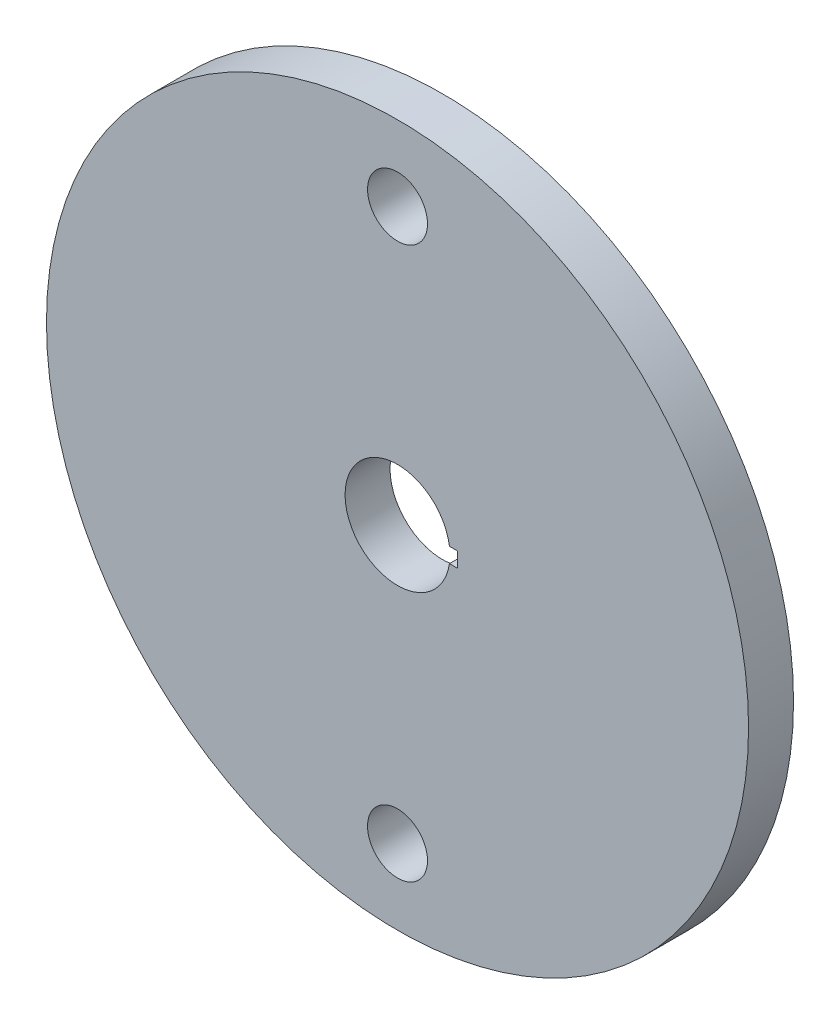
ISO-10303-21;
HEADER;
FILE_DESCRIPTION(('STEP AP214'),'2;1');
FILE_NAME('part.step','',(''),(''),'','','');
FILE_SCHEMA(('AUTOMOTIVE_DESIGN { 1 0 10303 214 1 1 1 1 }'));
ENDSEC;
DATA;
#1=APPLICATION_CONTEXT('core data for automotive mechanical design processes');
#2=APPLICATION_PROTOCOL_DEFINITION('international standard','automotive_design',2000,#1);
#3=PRODUCT_CONTEXT('',#1,'mechanical');
#4=PRODUCT('Part','Part','',(#3));
#5=PRODUCT_RELATED_PRODUCT_CATEGORY('part','',(#4));
#6=PRODUCT_DEFINITION_FORMATION('','',#4);
#7=PRODUCT_DEFINITION_CONTEXT('part definition',#1,'design');
#8=PRODUCT_DEFINITION('design','',#6,#7);
#9=PRODUCT_DEFINITION_SHAPE('','',#8);
#10=(LENGTH_UNIT() NAMED_UNIT(*) SI_UNIT(.MILLI.,.METRE.));
#11=(NAMED_UNIT(*) PLANE_ANGLE_UNIT() SI_UNIT($,.RADIAN.));
#12=(NAMED_UNIT(*) SI_UNIT($,.STERADIAN.) SOLID_ANGLE_UNIT());
#13=UNCERTAINTY_MEASURE_WITH_UNIT(LENGTH_MEASURE(1.E-05),#10,'distance_accuracy_value','');
#14=(GEOMETRIC_REPRESENTATION_CONTEXT(3) GLOBAL_UNCERTAINTY_ASSIGNED_CONTEXT((#13)) GLOBAL_UNIT_ASSIGNED_CONTEXT((#10,
#11,#12)) REPRESENTATION_CONTEXT('',''));
#15=CARTESIAN_POINT('',(0.,0.,0.));
#16=DIRECTION('',(0.,0.,1.));
#17=DIRECTION('',(1.,0.,0.));
#18=AXIS2_PLACEMENT_3D('',#15,#16,#17);
#19=CARTESIAN_POINT('',(127.,31.75,3.81));
#20=DIRECTION('',(0.,0.,-1.));
#21=DIRECTION('',(-1.,0.,0.));
#22=AXIS2_PLACEMENT_3D('',#19,#20,#21);
#23=CYLINDRICAL_SURFACE('',#22,29.7475774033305);
#24=CARTESIAN_POINT('',(127.,31.75,3.81));
#25=DIRECTION('',(0.,0.,1.));
#26=DIRECTION('',(1.,0.,0.));
#27=AXIS2_PLACEMENT_3D('',#24,#25,#26);
#28=CIRCLE('',#27,29.7475774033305);
#29=CARTESIAN_POINT('',(97.2524225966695,31.75,3.81));
#30=VERTEX_POINT('',#29);
#31=EDGE_CURVE('E104',#30,#30,#28,.T.);
#32=CARTESIAN_POINT('',(127.,31.75,0.));
#33=DIRECTION('',(0.,0.,1.));
#34=DIRECTION('',(1.,0.,0.));
#35=AXIS2_PLACEMENT_3D('',#32,#33,#34);
#36=CIRCLE('',#35,29.7475774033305);
#37=CARTESIAN_POINT('',(97.2524225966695,31.75,0.));
#38=VERTEX_POINT('',#37);
#39=EDGE_CURVE('E101',#38,#38,#36,.T.);
#40=CARTESIAN_POINT('',(97.2524225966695,31.75,3.81));
#41=CARTESIAN_POINT('',(97.2524225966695,31.75,3.7703125));
#42=CARTESIAN_POINT('',(97.2524225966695,31.75,3.730625));
#43=CARTESIAN_POINT('',(97.2524225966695,31.75,3.65125));
#44=CARTESIAN_POINT('',(97.2524225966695,31.75,3.6115625));
#45=CARTESIAN_POINT('',(97.2524225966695,31.75,3.5321875));
#46=CARTESIAN_POINT('',(97.2524225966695,31.75,3.4925));
#47=CARTESIAN_POINT('',(97.2524225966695,31.75,3.413125));
#48=CARTESIAN_POINT('',(97.2524225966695,31.75,3.3734375));
#49=CARTESIAN_POINT('',(97.2524225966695,31.75,3.2940625));
#50=CARTESIAN_POINT('',(97.2524225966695,31.75,3.254375));
#51=CARTESIAN_POINT('',(97.2524225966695,31.75,3.175));
#52=CARTESIAN_POINT('',(97.2524225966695,31.75,3.1353125));
#53=CARTESIAN_POINT('',(97.2524225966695,31.75,3.0559375));
#54=CARTESIAN_POINT('',(97.2524225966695,31.75,3.01625));
#55=CARTESIAN_POINT('',(97.2524225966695,31.75,2.936875));
#56=CARTESIAN_POINT('',(97.2524225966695,31.75,2.8971875));
#57=CARTESIAN_POINT('',(97.2524225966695,31.75,2.8178125));
#58=CARTESIAN_POINT('',(97.2524225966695,31.75,2.778125));
#59=CARTESIAN_POINT('',(97.2524225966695,31.75,2.69875));
#60=CARTESIAN_POINT('',(97.2524225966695,31.75,2.6590625));
#61=CARTESIAN_POINT('',(97.2524225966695,31.75,2.5796875));
#62=CARTESIAN_POINT('',(97.2524225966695,31.75,2.54));
#63=CARTESIAN_POINT('',(97.2524225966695,31.75,2.460625));
#64=CARTESIAN_POINT('',(97.2524225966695,31.75,2.4209375));
#65=CARTESIAN_POINT('',(97.2524225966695,31.75,2.3415625));
#66=CARTESIAN_POINT('',(97.2524225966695,31.75,2.301875));
#67=CARTESIAN_POINT('',(97.2524225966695,31.75,2.2225));
#68=CARTESIAN_POINT('',(97.2524225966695,31.75,2.1828125));
#69=CARTESIAN_POINT('',(97.2524225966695,31.75,2.1034375));
#70=CARTESIAN_POINT('',(97.2524225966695,31.75,2.06375));
#71=CARTESIAN_POINT('',(97.2524225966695,31.75,1.984375));
#72=CARTESIAN_POINT('',(97.2524225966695,31.75,1.9446875));
#73=CARTESIAN_POINT('',(97.2524225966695,31.75,1.8653125));
#74=CARTESIAN_POINT('',(97.2524225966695,31.75,1.825625));
#75=CARTESIAN_POINT('',(97.2524225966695,31.75,1.74625));
#76=CARTESIAN_POINT('',(97.2524225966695,31.75,1.7065625));
#77=CARTESIAN_POINT('',(97.2524225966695,31.75,1.6271875));
#78=CARTESIAN_POINT('',(97.2524225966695,31.75,1.5875));
#79=CARTESIAN_POINT('',(97.2524225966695,31.75,1.508125));
#80=CARTESIAN_POINT('',(97.2524225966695,31.75,1.4684375));
#81=CARTESIAN_POINT('',(97.2524225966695,31.75,1.3890625));
#82=CARTESIAN_POINT('',(97.2524225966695,31.75,1.349375));
#83=CARTESIAN_POINT('',(97.2524225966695,31.75,1.27));
#84=CARTESIAN_POINT('',(97.2524225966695,31.75,1.2303125));
#85=CARTESIAN_POINT('',(97.2524225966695,31.75,1.1509375));
#86=CARTESIAN_POINT('',(97.2524225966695,31.75,1.11125));
#87=CARTESIAN_POINT('',(97.2524225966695,31.75,1.031875));
#88=CARTESIAN_POINT('',(97.2524225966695,31.75,0.9921875));
#89=CARTESIAN_POINT('',(97.2524225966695,31.75,0.9128125));
#90=CARTESIAN_POINT('',(97.2524225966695,31.75,0.873125));
#91=CARTESIAN_POINT('',(97.2524225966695,31.75,0.79375));
#92=CARTESIAN_POINT('',(97.2524225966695,31.75,0.7540625));
#93=CARTESIAN_POINT('',(97.2524225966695,31.75,0.6746875));
#94=CARTESIAN_POINT('',(97.2524225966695,31.75,0.635));
#95=CARTESIAN_POINT('',(97.2524225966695,31.75,0.555625));
#96=CARTESIAN_POINT('',(97.2524225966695,31.75,0.5159375));
#97=CARTESIAN_POINT('',(97.2524225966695,31.75,0.4365625));
#98=CARTESIAN_POINT('',(97.2524225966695,31.75,0.396875));
#99=CARTESIAN_POINT('',(97.2524225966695,31.75,0.3175));
#100=CARTESIAN_POINT('',(97.2524225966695,31.75,0.2778125));
#101=CARTESIAN_POINT('',(97.2524225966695,31.75,0.1984375));
#102=CARTESIAN_POINT('',(97.2524225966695,31.75,0.15875));
#103=CARTESIAN_POINT('',(97.2524225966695,31.75,0.0793749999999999));
#104=CARTESIAN_POINT('',(97.2524225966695,31.75,0.0396874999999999));
#105=CARTESIAN_POINT('',(97.2524225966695,31.75,0.));
#106=B_SPLINE_CURVE_WITH_KNOTS('',3,(#40,#41,#42,#43,#44,#45,#46,#47,#48,#49,#50,#51,#52,#53,
#54,#55,#56,#57,#58,#59,#60,#61,#62,#63,#64,#65,#66,#67,#68,#69,#70,#71,#72,#73,#74,#75,#76,#77,
#78,#79,#80,#81,#82,#83,#84,#85,#86,#87,#88,#89,#90,#91,#92,#93,#94,#95,#96,#97,#98,#99,#100,
#101,#102,#103,#104,#105),.UNSPECIFIED.,.F.,.F.,(4,2,2,2,2,2,2,2,2,2,2,2,2,2,2,2,2,2,2,2,2,2,2,
2,2,2,2,2,2,2,2,2,4),(0.,0.1190625,0.238125,0.3571875,0.47625,0.595312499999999,0.714375,
0.833437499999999,0.952499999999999,1.0715625,1.190625,1.3096875,1.42875,1.5478125,1.666875,
1.7859375,1.905,2.0240625,2.143125,2.2621875,2.38125,2.5003125,2.619375,2.7384375,2.8575,
2.9765625,3.095625,3.2146875,3.33375,3.4528125,3.571875,3.6909375,3.81),.UNSPECIFIED.);
#107=EDGE_CURVE('BSEAM33',#30,#38,#106,.T.);
#108=ORIENTED_EDGE('',*,*,#31,.F.);
#109=ORIENTED_EDGE('',*,*,#39,.T.);
#110=ORIENTED_EDGE('',*,*,#107,.T.);
#111=ORIENTED_EDGE('',*,*,#107,.F.);
#112=EDGE_LOOP('',(#108,#110,#109,#111));
#113=FACE_BOUND('',#112,.T.);
#114=ADVANCED_FACE('F33',(#113),#23,.T.);
#115=CARTESIAN_POINT('',(127.,31.75,3.81));
#116=DIRECTION('',(0.,0.,1.));
#117=DIRECTION('',(1.,0.,0.));
#118=AXIS2_PLACEMENT_3D('',#115,#116,#117);
#119=PLANE('',#118);
#120=CARTESIAN_POINT('',(127.000000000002,8.38199999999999,3.81));
#121=DIRECTION('',(0.,0.,1.));
#122=DIRECTION('',(1.,0.,0.));
#123=AXIS2_PLACEMENT_3D('',#120,#121,#122);
#124=CIRCLE('',#123,2.53999999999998);
#125=CARTESIAN_POINT('',(129.540000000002,8.38199999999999,3.81));
#126=VERTEX_POINT('',#125);
#127=EDGE_CURVE('E122',#126,#126,#124,.T.);
#128=ORIENTED_EDGE('',*,*,#127,.F.);
#129=EDGE_LOOP('',(#128));
#130=FACE_BOUND('',#129,.T.);
#131=CARTESIAN_POINT('',(127.,55.118,3.81));
#132=DIRECTION('',(0.,0.,1.));
#133=DIRECTION('',(1.,0.,0.));
#134=AXIS2_PLACEMENT_3D('',#131,#132,#133);
#135=CIRCLE('',#134,2.53999999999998);
#136=CARTESIAN_POINT('',(129.54,55.118,3.81));
#137=VERTEX_POINT('',#136);
#138=EDGE_CURVE('E114',#137,#137,#135,.T.);
#139=ORIENTED_EDGE('',*,*,#138,.F.);
#140=EDGE_LOOP('',(#139));
#141=FACE_BOUND('',#140,.T.);
#142=CARTESIAN_POINT('',(127.,31.75,3.81));
#143=DIRECTION('',(0.,0.,1.));
#144=DIRECTION('',(1.,0.,0.));
#145=AXIS2_PLACEMENT_3D('',#142,#143,#144);
#146=CIRCLE('',#145,4.445);
#147=CARTESIAN_POINT('',(131.399409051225,32.385,3.81));
#148=VERTEX_POINT('',#147);
#149=CARTESIAN_POINT('',(131.399409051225,31.115,3.81));
#150=VERTEX_POINT('',#149);
#151=EDGE_CURVE('E49',#148,#150,#146,.T.);
#152=ORIENTED_EDGE('',*,*,#151,.F.);
#153=DIRECTION('',(1.,0.,0.));
#154=VECTOR('',#153,1.);
#155=CARTESIAN_POINT('',(0.,32.385,3.81));
#156=LINE('',#155,#154);
#157=CARTESIAN_POINT('',(132.08,32.385,3.81));
#158=VERTEX_POINT('',#157);
#159=EDGE_CURVE('E94',#148,#158,#156,.T.);
#160=ORIENTED_EDGE('',*,*,#159,.T.);
#161=DIRECTION('',(0.,-1.,0.));
#162=VECTOR('',#161,1.);
#163=CARTESIAN_POINT('',(132.08,0.,3.81));
#164=LINE('',#163,#162);
#165=CARTESIAN_POINT('',(132.08,31.115,3.81));
#166=VERTEX_POINT('',#165);
#167=EDGE_CURVE('E78',#158,#166,#164,.T.);
#168=ORIENTED_EDGE('',*,*,#167,.T.);
#169=DIRECTION('',(1.,0.,0.));
#170=VECTOR('',#169,1.);
#171=CARTESIAN_POINT('',(0.,31.115,3.81));
#172=LINE('',#171,#170);
#173=EDGE_CURVE('E87',#150,#166,#172,.T.);
#174=ORIENTED_EDGE('',*,*,#173,.F.);
#175=EDGE_LOOP('',(#152,#160,#168,#174));
#176=FACE_BOUND('',#175,.T.);
#177=ORIENTED_EDGE('',*,*,#31,.T.);
#178=EDGE_LOOP('',(#177));
#179=FACE_BOUND('',#178,.T.);
#180=ADVANCED_FACE('F91',(#130,#141,#176,#179),#119,.T.);
#181=CARTESIAN_POINT('',(127.,31.75,0.));
#182=DIRECTION('',(0.,0.,1.));
#183=DIRECTION('',(1.,0.,0.));
#184=AXIS2_PLACEMENT_3D('',#181,#182,#183);
#185=PLANE('',#184);
#186=CARTESIAN_POINT('',(127.000000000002,8.38199999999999,0.));
#187=DIRECTION('',(0.,0.,1.));
#188=DIRECTION('',(1.,0.,0.));
#189=AXIS2_PLACEMENT_3D('',#186,#187,#188);
#190=CIRCLE('',#189,2.53999999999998);
#191=CARTESIAN_POINT('',(129.540000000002,8.38199999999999,0.));
#192=VERTEX_POINT('',#191);
#193=EDGE_CURVE('E36',#192,#192,#190,.T.);
#194=ORIENTED_EDGE('',*,*,#193,.T.);
#195=EDGE_LOOP('',(#194));
#196=FACE_BOUND('',#195,.T.);
#197=CARTESIAN_POINT('',(127.,55.118,0.));
#198=DIRECTION('',(0.,0.,1.));
#199=DIRECTION('',(1.,0.,0.));
#200=AXIS2_PLACEMENT_3D('',#197,#198,#199);
#201=CIRCLE('',#200,2.53999999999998);
#202=CARTESIAN_POINT('',(129.54,55.118,0.));
#203=VERTEX_POINT('',#202);
#204=EDGE_CURVE('E112',#203,#203,#201,.T.);
#205=ORIENTED_EDGE('',*,*,#204,.T.);
#206=EDGE_LOOP('',(#205));
#207=FACE_BOUND('',#206,.T.);
#208=DIRECTION('',(1.,0.,0.));
#209=VECTOR('',#208,1.);
#210=CARTESIAN_POINT('',(127.,32.385,0.));
#211=LINE('',#210,#209);
#212=CARTESIAN_POINT('',(131.399409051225,32.385,0.));
#213=VERTEX_POINT('',#212);
#214=CARTESIAN_POINT('',(132.08,32.385,0.));
#215=VERTEX_POINT('',#214);
#216=EDGE_CURVE('E41',#213,#215,#211,.T.);
#217=ORIENTED_EDGE('',*,*,#216,.F.);
#218=CARTESIAN_POINT('',(127.,31.75,0.));
#219=DIRECTION('',(0.,0.,1.));
#220=DIRECTION('',(1.,0.,0.));
#221=AXIS2_PLACEMENT_3D('',#218,#219,#220);
#222=CIRCLE('',#221,4.445);
#223=CARTESIAN_POINT('',(131.399409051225,31.115,0.));
#224=VERTEX_POINT('',#223);
#225=EDGE_CURVE('E11',#213,#224,#222,.T.);
#226=ORIENTED_EDGE('',*,*,#225,.T.);
#227=DIRECTION('',(1.,0.,0.));
#228=VECTOR('',#227,1.);
#229=CARTESIAN_POINT('',(127.,31.115,0.));
#230=LINE('',#229,#228);
#231=CARTESIAN_POINT('',(132.08,31.115,0.));
#232=VERTEX_POINT('',#231);
#233=EDGE_CURVE('E107',#224,#232,#230,.T.);
#234=ORIENTED_EDGE('',*,*,#233,.T.);
#235=DIRECTION('',(0.,-1.,0.));
#236=VECTOR('',#235,1.);
#237=CARTESIAN_POINT('',(132.08,31.75,0.));
#238=LINE('',#237,#236);
#239=EDGE_CURVE('E81',#215,#232,#238,.T.);
#240=ORIENTED_EDGE('',*,*,#239,.F.);
#241=EDGE_LOOP('',(#217,#226,#234,#240));
#242=FACE_BOUND('',#241,.T.);
#243=ORIENTED_EDGE('',*,*,#39,.F.);
#244=EDGE_LOOP('',(#243));
#245=FACE_BOUND('',#244,.T.);
#246=ADVANCED_FACE('F132',(#196,#207,#242,#245),#185,.F.);
#247=CARTESIAN_POINT('',(127.,31.75,-1.27));
#248=DIRECTION('',(0.,0.,1.));
#249=DIRECTION('',(1.,0.,0.));
#250=AXIS2_PLACEMENT_3D('',#247,#248,#249);
#251=CYLINDRICAL_SURFACE('',#250,4.445);
#252=DIRECTION('',(0.,0.,1.));
#253=VECTOR('',#252,1.);
#254=CARTESIAN_POINT('',(131.399409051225,32.385,-1.27));
#255=LINE('',#254,#253);
#256=EDGE_CURVE('E99',#213,#148,#255,.T.);
#257=ORIENTED_EDGE('',*,*,#256,.T.);
#258=ORIENTED_EDGE('',*,*,#151,.T.);
#259=DIRECTION('',(0.,0.,1.));
#260=VECTOR('',#259,1.);
#261=CARTESIAN_POINT('',(131.399409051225,31.115,-1.27));
#262=LINE('',#261,#260);
#263=EDGE_CURVE('E84',#224,#150,#262,.T.);
#264=ORIENTED_EDGE('',*,*,#263,.F.);
#265=ORIENTED_EDGE('',*,*,#225,.F.);
#266=EDGE_LOOP('',(#257,#258,#264,#265));
#267=FACE_BOUND('',#266,.T.);
#268=ADVANCED_FACE('F138',(#267),#251,.F.);
#269=CARTESIAN_POINT('',(0.,32.385,-1.27));
#270=DIRECTION('',(0.,-1.,0.));
#271=DIRECTION('',(0.,0.,-1.));
#272=AXIS2_PLACEMENT_3D('',#269,#270,#271);
#273=PLANE('',#272);
#274=ORIENTED_EDGE('',*,*,#216,.T.);
#275=DIRECTION('',(0.,0.,1.));
#276=VECTOR('',#275,1.);
#277=CARTESIAN_POINT('',(132.08,32.385,-1.27));
#278=LINE('',#277,#276);
#279=EDGE_CURVE('E83',#215,#158,#278,.T.);
#280=ORIENTED_EDGE('',*,*,#279,.T.);
#281=ORIENTED_EDGE('',*,*,#159,.F.);
#282=ORIENTED_EDGE('',*,*,#256,.F.);
#283=EDGE_LOOP('',(#274,#280,#281,#282));
#284=FACE_BOUND('',#283,.T.);
#285=ADVANCED_FACE('F144',(#284),#273,.T.);
#286=CARTESIAN_POINT('',(132.08,0.,-1.27));
#287=DIRECTION('',(-1.,0.,0.));
#288=DIRECTION('',(0.,0.,1.));
#289=AXIS2_PLACEMENT_3D('',#286,#287,#288);
#290=PLANE('',#289);
#291=ORIENTED_EDGE('',*,*,#239,.T.);
#292=DIRECTION('',(0.,0.,1.));
#293=VECTOR('',#292,1.);
#294=CARTESIAN_POINT('',(132.08,31.115,-1.27));
#295=LINE('',#294,#293);
#296=EDGE_CURVE('E57',#232,#166,#295,.T.);
#297=ORIENTED_EDGE('',*,*,#296,.T.);
#298=ORIENTED_EDGE('',*,*,#167,.F.);
#299=ORIENTED_EDGE('',*,*,#279,.F.);
#300=EDGE_LOOP('',(#291,#297,#298,#299));
#301=FACE_BOUND('',#300,.T.);
#302=ADVANCED_FACE('F75',(#301),#290,.T.);
#303=CARTESIAN_POINT('',(0.,31.115,-1.27));
#304=DIRECTION('',(0.,-1.,0.));
#305=DIRECTION('',(0.,0.,-1.));
#306=AXIS2_PLACEMENT_3D('',#303,#304,#305);
#307=PLANE('',#306);
#308=ORIENTED_EDGE('',*,*,#263,.T.);
#309=ORIENTED_EDGE('',*,*,#173,.T.);
#310=ORIENTED_EDGE('',*,*,#296,.F.);
#311=ORIENTED_EDGE('',*,*,#233,.F.);
#312=EDGE_LOOP('',(#308,#309,#310,#311));
#313=FACE_BOUND('',#312,.T.);
#314=ADVANCED_FACE('F88',(#313),#307,.F.);
#315=CARTESIAN_POINT('',(127.,55.118,-1.27));
#316=DIRECTION('',(0.,0.,1.));
#317=DIRECTION('',(1.,0.,0.));
#318=AXIS2_PLACEMENT_3D('',#315,#316,#317);
#319=CYLINDRICAL_SURFACE('',#318,2.53999999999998);
#320=ORIENTED_EDGE('',*,*,#138,.T.);
#321=EDGE_LOOP('',(#320));
#322=FACE_BOUND('',#321,.T.);
#323=ORIENTED_EDGE('',*,*,#204,.F.);
#324=EDGE_LOOP('',(#323));
#325=FACE_BOUND('',#324,.T.);
#326=ADVANCED_FACE('F147',(#322,#325),#319,.F.);
#327=CARTESIAN_POINT('',(127.000000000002,8.38199999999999,-1.27));
#328=DIRECTION('',(0.,0.,1.));
#329=DIRECTION('',(1.,0.,0.));
#330=AXIS2_PLACEMENT_3D('',#327,#328,#329);
#331=CYLINDRICAL_SURFACE('',#330,2.53999999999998);
#332=ORIENTED_EDGE('',*,*,#127,.T.);
#333=EDGE_LOOP('',(#332));
#334=FACE_BOUND('',#333,.T.);
#335=ORIENTED_EDGE('',*,*,#193,.F.);
#336=EDGE_LOOP('',(#335));
#337=FACE_BOUND('',#336,.T.);
#338=ADVANCED_FACE('F127',(#334,#337),#331,.F.);
#339=CLOSED_SHELL('',(#114,#180,#246,#268,#285,#302,#314,#326,#338));
#340=MANIFOLD_SOLID_BREP('B2',#339);
#341=ADVANCED_BREP_SHAPE_REPRESENTATION('',(#18,#340),#14);
#342=SHAPE_DEFINITION_REPRESENTATION(#9,#341);
ENDSEC;
END-ISO-10303-21;
